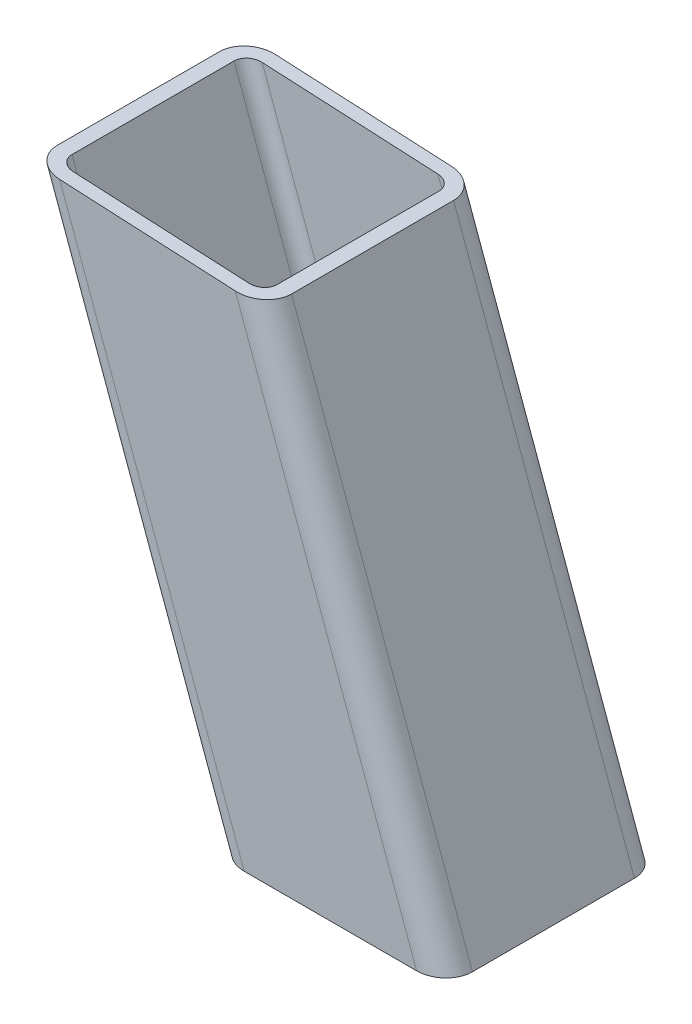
ISO-10303-21;
HEADER;
FILE_DESCRIPTION(('STEP AP214'),'2;1');
FILE_NAME('part.step','',(''),(''),'','','');
FILE_SCHEMA(('AUTOMOTIVE_DESIGN { 1 0 10303 214 1 1 1 1 }'));
ENDSEC;
DATA;
#1=APPLICATION_CONTEXT('core data for automotive mechanical design processes');
#2=APPLICATION_PROTOCOL_DEFINITION('international standard','automotive_design',2000,#1);
#3=PRODUCT_CONTEXT('',#1,'mechanical');
#4=PRODUCT('Part','Part','',(#3));
#5=PRODUCT_RELATED_PRODUCT_CATEGORY('part','',(#4));
#6=PRODUCT_DEFINITION_FORMATION('','',#4);
#7=PRODUCT_DEFINITION_CONTEXT('part definition',#1,'design');
#8=PRODUCT_DEFINITION('design','',#6,#7);
#9=PRODUCT_DEFINITION_SHAPE('','',#8);
#10=(LENGTH_UNIT() NAMED_UNIT(*) SI_UNIT(.MILLI.,.METRE.));
#11=(NAMED_UNIT(*) PLANE_ANGLE_UNIT() SI_UNIT($,.RADIAN.));
#12=(NAMED_UNIT(*) SI_UNIT($,.STERADIAN.) SOLID_ANGLE_UNIT());
#13=UNCERTAINTY_MEASURE_WITH_UNIT(LENGTH_MEASURE(1.E-05),#10,'distance_accuracy_value','');
#14=(GEOMETRIC_REPRESENTATION_CONTEXT(3) GLOBAL_UNCERTAINTY_ASSIGNED_CONTEXT((#13)) GLOBAL_UNIT_ASSIGNED_CONTEXT((#10,
#11,#12)) REPRESENTATION_CONTEXT('',''));
#15=CARTESIAN_POINT('',(0.,0.,0.));
#16=DIRECTION('',(0.,0.,1.));
#17=DIRECTION('',(1.,0.,0.));
#18=AXIS2_PLACEMENT_3D('',#15,#16,#17);
#19=CARTESIAN_POINT('',(2568.84586301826,13.6808057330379,30.));
#20=DIRECTION('',(-0.939692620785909,-0.342020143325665,0.));
#21=DIRECTION('',(0.342020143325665,-0.93969262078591,0.));
#22=AXIS2_PLACEMENT_3D('',#19,#20,#21);
#23=PLANE('',#22);
#24=DIRECTION('',(0.,0.,1.));
#25=VECTOR('',#24,1.);
#26=CARTESIAN_POINT('',(2553.07896573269,56.9999999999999,30.0000000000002));
#27=LINE('',#26,#25);
#28=CARTESIAN_POINT('',(2553.07896573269,57.,-30.));
#29=VERTEX_POINT('',#28);
#30=CARTESIAN_POINT('',(2553.07896573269,56.9999999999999,30.));
#31=VERTEX_POINT('',#30);
#32=EDGE_CURVE('E53',#29,#31,#27,.T.);
#33=ORIENTED_EDGE('',*,*,#32,.F.);
#34=DIRECTION('',(-0.342020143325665,0.93969262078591,0.));
#35=VECTOR('',#34,1.);
#36=CARTESIAN_POINT('',(2568.84586301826,13.6808057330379,-30.));
#37=LINE('',#36,#35);
#38=CARTESIAN_POINT('',(2486.14102471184,240.910481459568,-30.));
#39=VERTEX_POINT('',#38);
#40=EDGE_CURVE('E38',#29,#39,#37,.T.);
#41=ORIENTED_EDGE('',*,*,#40,.T.);
#42=DIRECTION('',(0.,0.,-1.));
#43=VECTOR('',#42,1.);
#44=CARTESIAN_POINT('',(2486.14102471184,240.910481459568,30.));
#45=LINE('',#44,#43);
#46=CARTESIAN_POINT('',(2486.14102471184,240.910481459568,30.));
#47=VERTEX_POINT('',#46);
#48=EDGE_CURVE('E107',#47,#39,#45,.T.);
#49=ORIENTED_EDGE('',*,*,#48,.F.);
#50=DIRECTION('',(-0.342020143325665,0.93969262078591,0.));
#51=VECTOR('',#50,1.);
#52=CARTESIAN_POINT('',(2568.84586301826,13.6808057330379,30.));
#53=LINE('',#52,#51);
#54=EDGE_CURVE('E185',#31,#47,#53,.T.);
#55=ORIENTED_EDGE('',*,*,#54,.F.);
#56=EDGE_LOOP('',(#33,#41,#49,#55));
#57=FACE_BOUND('',#56,.T.);
#58=ADVANCED_FACE('F34',(#57),#23,.F.);
#59=CARTESIAN_POINT('',(2559.4489368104,10.2606042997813,-30.));
#60=DIRECTION('',(-0.342020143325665,0.93969262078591,0.));
#61=DIRECTION('',(-0.93969262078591,-0.342020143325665,0.));
#62=AXIS2_PLACEMENT_3D('',#59,#60,#61);
#63=CYLINDRICAL_SURFACE('',#62,10.);
#64=CARTESIAN_POINT('',(2542.43718800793,57.0000000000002,-30.));
#65=DIRECTION('',(0.,-1.,0.));
#66=DIRECTION('',(-1.,0.,0.));
#67=AXIS2_PLACEMENT_3D('',#64,#65,#66);
#68=ELLIPSE('',#67,10.6417777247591,10.);
#69=CARTESIAN_POINT('',(2542.43718800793,57.0000000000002,-40.));
#70=VERTEX_POINT('',#69);
#71=EDGE_CURVE('E155',#70,#29,#68,.T.);
#72=ORIENTED_EDGE('',*,*,#71,.F.);
#73=DIRECTION('',(-0.342020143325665,0.93969262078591,0.));
#74=VECTOR('',#73,1.);
#75=CARTESIAN_POINT('',(2559.4489368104,10.2606042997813,-40.));
#76=LINE('',#75,#74);
#77=CARTESIAN_POINT('',(2475.30171823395,241.453187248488,-40.));
#78=VERTEX_POINT('',#77);
#79=EDGE_CURVE('E165',#70,#78,#76,.T.);
#80=ORIENTED_EDGE('',*,*,#79,.T.);
#81=CARTESIAN_POINT('',(2475.30171823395,241.453187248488,-30.));
#82=DIRECTION('',(0.0500056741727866,0.998748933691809,0.));
#83=DIRECTION('',(-0.998748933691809,0.0500056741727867,0.));
#84=AXIS2_PLACEMENT_3D('',#81,#82,#83);
#85=ELLIPSE('',#84,10.8528841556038,10.);
#86=EDGE_CURVE('E102',#39,#78,#85,.T.);
#87=ORIENTED_EDGE('',*,*,#86,.F.);
#88=ORIENTED_EDGE('',*,*,#40,.F.);
#89=EDGE_LOOP('',(#72,#80,#87,#88));
#90=FACE_BOUND('',#89,.T.);
#91=ADVANCED_FACE('F164',(#90),#63,.T.);
#92=CARTESIAN_POINT('',(2503.06737956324,-10.2606042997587,-40.));
#93=DIRECTION('',(0.,0.,1.));
#94=DIRECTION('',(1.,0.,0.));
#95=AXIS2_PLACEMENT_3D('',#92,#93,#94);
#96=PLANE('',#95);
#97=DIRECTION('',(1.,0.,0.));
#98=VECTOR('',#97,1.);
#99=CARTESIAN_POINT('',(2503.06737956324,57.0000000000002,-40.));
#100=LINE('',#99,#98);
#101=CARTESIAN_POINT('',(2478.58652165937,57.0000000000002,-40.));
#102=VERTEX_POINT('',#101);
#103=EDGE_CURVE('E152',#102,#70,#100,.T.);
#104=ORIENTED_EDGE('',*,*,#103,.F.);
#105=DIRECTION('',(-0.342020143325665,0.93969262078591,0.));
#106=VECTOR('',#105,1.);
#107=CARTESIAN_POINT('',(2503.06737956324,-10.2606042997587,-40.));
#108=LINE('',#107,#106);
#109=CARTESIAN_POINT('',(2410.26587936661,244.709421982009,-40.));
#110=VERTEX_POINT('',#109);
#111=EDGE_CURVE('E170',#102,#110,#108,.T.);
#112=ORIENTED_EDGE('',*,*,#111,.T.);
#113=DIRECTION('',(-0.998748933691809,0.0500056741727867,0.));
#114=VECTOR('',#113,1.);
#115=CARTESIAN_POINT('',(2515.56932018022,239.437056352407,-40.));
#116=LINE('',#115,#114);
#117=EDGE_CURVE('E169',#78,#110,#116,.T.);
#118=ORIENTED_EDGE('',*,*,#117,.F.);
#119=ORIENTED_EDGE('',*,*,#79,.F.);
#120=EDGE_LOOP('',(#104,#112,#118,#119));
#121=FACE_BOUND('',#120,.T.);
#122=ADVANCED_FACE('F168',(#121),#96,.F.);
#123=CARTESIAN_POINT('',(2503.06737956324,-10.2606042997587,-30.));
#124=DIRECTION('',(-0.342020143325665,0.93969262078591,0.));
#125=DIRECTION('',(-0.93969262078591,-0.342020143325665,0.));
#126=AXIS2_PLACEMENT_3D('',#123,#124,#125);
#127=CYLINDRICAL_SURFACE('',#126,10.);
#128=CARTESIAN_POINT('',(2478.58652165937,57.0000000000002,-30.));
#129=DIRECTION('',(0.,-1.,0.));
#130=DIRECTION('',(-1.,0.,0.));
#131=AXIS2_PLACEMENT_3D('',#128,#129,#130);
#132=ELLIPSE('',#131,10.6417777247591,10.);
#133=CARTESIAN_POINT('',(2467.94474393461,57.0000000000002,-30.));
#134=VERTEX_POINT('',#133);
#135=EDGE_CURVE('E150',#134,#102,#132,.T.);
#136=ORIENTED_EDGE('',*,*,#135,.F.);
#137=DIRECTION('',(-0.342020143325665,0.93969262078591,0.));
#138=VECTOR('',#137,1.);
#139=CARTESIAN_POINT('',(2493.67045335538,-13.6808057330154,-30.));
#140=LINE('',#139,#138);
#141=CARTESIAN_POINT('',(2399.42657288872,245.252127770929,-30.));
#142=VERTEX_POINT('',#141);
#143=EDGE_CURVE('E171',#134,#142,#140,.T.);
#144=ORIENTED_EDGE('',*,*,#143,.T.);
#145=CARTESIAN_POINT('',(2410.26587936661,244.709421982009,-30.));
#146=DIRECTION('',(0.0500056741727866,0.998748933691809,0.));
#147=DIRECTION('',(-0.998748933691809,0.0500056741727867,0.));
#148=AXIS2_PLACEMENT_3D('',#145,#146,#147);
#149=ELLIPSE('',#148,10.8528841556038,10.);
#150=EDGE_CURVE('E228',#110,#142,#149,.T.);
#151=ORIENTED_EDGE('',*,*,#150,.F.);
#152=ORIENTED_EDGE('',*,*,#111,.F.);
#153=EDGE_LOOP('',(#136,#144,#151,#152));
#154=FACE_BOUND('',#153,.T.);
#155=ADVANCED_FACE('F325',(#154),#127,.T.);
#156=CARTESIAN_POINT('',(2493.67045335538,-13.6808057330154,-30.));
#157=DIRECTION('',(0.939692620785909,0.342020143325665,0.));
#158=DIRECTION('',(-0.342020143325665,0.93969262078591,0.));
#159=AXIS2_PLACEMENT_3D('',#156,#157,#158);
#160=PLANE('',#159);
#161=DIRECTION('',(0.,0.,-1.));
#162=VECTOR('',#161,1.);
#163=CARTESIAN_POINT('',(2467.94474393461,57.0000000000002,-29.9999999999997));
#164=LINE('',#163,#162);
#165=CARTESIAN_POINT('',(2467.94474393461,56.9999999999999,30.));
#166=VERTEX_POINT('',#165);
#167=EDGE_CURVE('E253',#166,#134,#164,.T.);
#168=ORIENTED_EDGE('',*,*,#167,.F.);
#169=DIRECTION('',(-0.342020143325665,0.93969262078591,0.));
#170=VECTOR('',#169,1.);
#171=CARTESIAN_POINT('',(2493.67045335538,-13.6808057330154,30.));
#172=LINE('',#171,#170);
#173=CARTESIAN_POINT('',(2399.42657288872,245.252127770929,30.));
#174=VERTEX_POINT('',#173);
#175=EDGE_CURVE('E176',#166,#174,#172,.T.);
#176=ORIENTED_EDGE('',*,*,#175,.T.);
#177=DIRECTION('',(0.,0.,1.));
#178=VECTOR('',#177,1.);
#179=CARTESIAN_POINT('',(2399.42657288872,245.252127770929,-30.0000000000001));
#180=LINE('',#179,#178);
#181=EDGE_CURVE('E230',#142,#174,#180,.T.);
#182=ORIENTED_EDGE('',*,*,#181,.F.);
#183=ORIENTED_EDGE('',*,*,#143,.F.);
#184=EDGE_LOOP('',(#168,#176,#182,#183));
#185=FACE_BOUND('',#184,.T.);
#186=ADVANCED_FACE('F328',(#185),#160,.F.);
#187=CARTESIAN_POINT('',(2503.06737956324,-10.2606042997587,30.));
#188=DIRECTION('',(-0.342020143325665,0.93969262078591,0.));
#189=DIRECTION('',(-0.93969262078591,-0.342020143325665,0.));
#190=AXIS2_PLACEMENT_3D('',#187,#188,#189);
#191=CYLINDRICAL_SURFACE('',#190,10.);
#192=CARTESIAN_POINT('',(2478.58652165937,56.9999999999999,30.));
#193=DIRECTION('',(0.,-1.,0.));
#194=DIRECTION('',(-1.,0.,0.));
#195=AXIS2_PLACEMENT_3D('',#192,#193,#194);
#196=ELLIPSE('',#195,10.6417777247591,10.);
#197=CARTESIAN_POINT('',(2478.58652165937,56.9999999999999,40.));
#198=VERTEX_POINT('',#197);
#199=EDGE_CURVE('E255',#198,#166,#196,.T.);
#200=ORIENTED_EDGE('',*,*,#199,.F.);
#201=DIRECTION('',(-0.342020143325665,0.93969262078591,0.));
#202=VECTOR('',#201,1.);
#203=CARTESIAN_POINT('',(2503.06737956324,-10.2606042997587,40.));
#204=LINE('',#203,#202);
#205=CARTESIAN_POINT('',(2410.26587936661,244.709421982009,40.));
#206=VERTEX_POINT('',#205);
#207=EDGE_CURVE('E179',#198,#206,#204,.T.);
#208=ORIENTED_EDGE('',*,*,#207,.T.);
#209=CARTESIAN_POINT('',(2410.26587936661,244.709421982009,30.));
#210=DIRECTION('',(0.0500056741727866,0.998748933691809,0.));
#211=DIRECTION('',(-0.998748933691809,0.0500056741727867,0.));
#212=AXIS2_PLACEMENT_3D('',#209,#210,#211);
#213=ELLIPSE('',#212,10.8528841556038,10.);
#214=EDGE_CURVE('E232',#174,#206,#213,.T.);
#215=ORIENTED_EDGE('',*,*,#214,.F.);
#216=ORIENTED_EDGE('',*,*,#175,.F.);
#217=EDGE_LOOP('',(#200,#208,#215,#216));
#218=FACE_BOUND('',#217,.T.);
#219=ADVANCED_FACE('F332',(#218),#191,.T.);
#220=CARTESIAN_POINT('',(2559.4489368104,10.2606042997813,40.));
#221=DIRECTION('',(0.,0.,-1.));
#222=DIRECTION('',(-1.,0.,0.));
#223=AXIS2_PLACEMENT_3D('',#220,#221,#222);
#224=PLANE('',#223);
#225=DIRECTION('',(-1.,0.,0.));
#226=VECTOR('',#225,1.);
#227=CARTESIAN_POINT('',(2559.4489368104,56.9999999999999,40.));
#228=LINE('',#227,#226);
#229=CARTESIAN_POINT('',(2542.43718800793,56.9999999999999,40.));
#230=VERTEX_POINT('',#229);
#231=EDGE_CURVE('E257',#230,#198,#228,.T.);
#232=ORIENTED_EDGE('',*,*,#231,.F.);
#233=DIRECTION('',(-0.342020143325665,0.93969262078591,0.));
#234=VECTOR('',#233,1.);
#235=CARTESIAN_POINT('',(2559.4489368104,10.2606042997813,40.));
#236=LINE('',#235,#234);
#237=CARTESIAN_POINT('',(2475.30171823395,241.453187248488,40.));
#238=VERTEX_POINT('',#237);
#239=EDGE_CURVE('E182',#230,#238,#236,.T.);
#240=ORIENTED_EDGE('',*,*,#239,.T.);
#241=DIRECTION('',(0.998748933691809,-0.0500056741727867,0.));
#242=VECTOR('',#241,1.);
#243=CARTESIAN_POINT('',(2570.78499848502,236.672500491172,40.));
#244=LINE('',#243,#242);
#245=EDGE_CURVE('E234',#206,#238,#244,.T.);
#246=ORIENTED_EDGE('',*,*,#245,.F.);
#247=ORIENTED_EDGE('',*,*,#207,.F.);
#248=EDGE_LOOP('',(#232,#240,#246,#247));
#249=FACE_BOUND('',#248,.T.);
#250=ADVANCED_FACE('F335',(#249),#224,.F.);
#251=CARTESIAN_POINT('',(2559.4489368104,10.2606042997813,30.));
#252=DIRECTION('',(-0.342020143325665,0.93969262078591,0.));
#253=DIRECTION('',(-0.93969262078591,-0.342020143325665,0.));
#254=AXIS2_PLACEMENT_3D('',#251,#252,#253);
#255=CYLINDRICAL_SURFACE('',#254,10.);
#256=CARTESIAN_POINT('',(2542.43718800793,56.9999999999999,30.));
#257=DIRECTION('',(0.,-1.,0.));
#258=DIRECTION('',(-1.,0.,0.));
#259=AXIS2_PLACEMENT_3D('',#256,#257,#258);
#260=ELLIPSE('',#259,10.6417777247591,10.);
#261=EDGE_CURVE('E236',#31,#230,#260,.T.);
#262=ORIENTED_EDGE('',*,*,#261,.F.);
#263=ORIENTED_EDGE('',*,*,#54,.T.);
#264=CARTESIAN_POINT('',(2475.30171823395,241.453187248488,30.));
#265=DIRECTION('',(0.0500056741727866,0.998748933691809,0.));
#266=DIRECTION('',(-0.998748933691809,0.0500056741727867,0.));
#267=AXIS2_PLACEMENT_3D('',#264,#265,#266);
#268=ELLIPSE('',#267,10.8528841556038,10.);
#269=EDGE_CURVE('E110',#238,#47,#268,.T.);
#270=ORIENTED_EDGE('',*,*,#269,.F.);
#271=ORIENTED_EDGE('',*,*,#239,.F.);
#272=EDGE_LOOP('',(#262,#263,#270,#271));
#273=FACE_BOUND('',#272,.T.);
#274=ADVANCED_FACE('F36',(#273),#255,.T.);
#275=CARTESIAN_POINT('',(6158.08276398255,57.0625533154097,-40.));
#276=DIRECTION('',(0.0500056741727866,0.998748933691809,0.));
#277=DIRECTION('',(-0.998748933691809,0.0500056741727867,0.));
#278=AXIS2_PLACEMENT_3D('',#275,#276,#277);
#279=PLANE('',#278);
#280=DIRECTION('',(0.,0.,1.));
#281=VECTOR('',#280,1.);
#282=CARTESIAN_POINT('',(2404.84622612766,244.980774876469,-30.));
#283=LINE('',#282,#281);
#284=CARTESIAN_POINT('',(2404.84622612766,244.980774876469,-30.));
#285=VERTEX_POINT('',#284);
#286=CARTESIAN_POINT('',(2404.84622612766,244.980774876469,30.));
#287=VERTEX_POINT('',#286);
#288=EDGE_CURVE('E191',#285,#287,#283,.T.);
#289=ORIENTED_EDGE('',*,*,#288,.F.);
#290=CARTESIAN_POINT('',(2410.26587936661,244.709421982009,-30.));
#291=DIRECTION('',(0.0500056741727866,0.998748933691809,0.));
#292=DIRECTION('',(-0.998748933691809,0.0500056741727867,0.));
#293=AXIS2_PLACEMENT_3D('',#290,#291,#292);
#294=ELLIPSE('',#293,5.4264420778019,5.00000000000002);
#295=CARTESIAN_POINT('',(2410.26587936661,244.709421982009,-35.));
#296=VERTEX_POINT('',#295);
#297=EDGE_CURVE('E196',#296,#285,#294,.T.);
#298=ORIENTED_EDGE('',*,*,#297,.F.);
#299=DIRECTION('',(-0.998748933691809,0.0500056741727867,0.));
#300=VECTOR('',#299,1.);
#301=CARTESIAN_POINT('',(2515.56932018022,239.437056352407,-35.));
#302=LINE('',#301,#300);
#303=CARTESIAN_POINT('',(2475.30171823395,241.453187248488,-35.));
#304=VERTEX_POINT('',#303);
#305=EDGE_CURVE('E201',#304,#296,#302,.T.);
#306=ORIENTED_EDGE('',*,*,#305,.F.);
#307=CARTESIAN_POINT('',(2475.30171823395,241.453187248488,-30.));
#308=DIRECTION('',(0.0500056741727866,0.998748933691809,0.));
#309=DIRECTION('',(-0.998748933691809,0.0500056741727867,0.));
#310=AXIS2_PLACEMENT_3D('',#307,#308,#309);
#311=ELLIPSE('',#310,5.42644207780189,5.00000000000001);
#312=CARTESIAN_POINT('',(2480.72137147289,241.181834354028,-30.));
#313=VERTEX_POINT('',#312);
#314=EDGE_CURVE('E206',#313,#304,#311,.T.);
#315=ORIENTED_EDGE('',*,*,#314,.F.);
#316=DIRECTION('',(0.,0.,-1.));
#317=VECTOR('',#316,1.);
#318=CARTESIAN_POINT('',(2480.72137147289,241.181834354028,30.));
#319=LINE('',#318,#317);
#320=CARTESIAN_POINT('',(2480.72137147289,241.181834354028,30.));
#321=VERTEX_POINT('',#320);
#322=EDGE_CURVE('E211',#321,#313,#319,.T.);
#323=ORIENTED_EDGE('',*,*,#322,.F.);
#324=CARTESIAN_POINT('',(2475.30171823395,241.453187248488,30.));
#325=DIRECTION('',(0.0500056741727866,0.998748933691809,0.));
#326=DIRECTION('',(-0.998748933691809,0.0500056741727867,0.));
#327=AXIS2_PLACEMENT_3D('',#324,#325,#326);
#328=ELLIPSE('',#327,5.42644207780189,5.00000000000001);
#329=CARTESIAN_POINT('',(2475.30171823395,241.453187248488,35.));
#330=VERTEX_POINT('',#329);
#331=EDGE_CURVE('E216',#330,#321,#328,.T.);
#332=ORIENTED_EDGE('',*,*,#331,.F.);
#333=DIRECTION('',(0.998748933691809,-0.0500056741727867,0.));
#334=VECTOR('',#333,1.);
#335=CARTESIAN_POINT('',(2570.78499848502,236.672500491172,35.));
#336=LINE('',#335,#334);
#337=CARTESIAN_POINT('',(2410.26587936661,244.709421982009,35.));
#338=VERTEX_POINT('',#337);
#339=EDGE_CURVE('E221',#338,#330,#336,.T.);
#340=ORIENTED_EDGE('',*,*,#339,.F.);
#341=CARTESIAN_POINT('',(2410.26587936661,244.709421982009,30.));
#342=DIRECTION('',(0.0500056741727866,0.998748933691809,0.));
#343=DIRECTION('',(-0.998748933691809,0.0500056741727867,0.));
#344=AXIS2_PLACEMENT_3D('',#341,#342,#343);
#345=ELLIPSE('',#344,5.42644207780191,5.00000000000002);
#346=EDGE_CURVE('E11',#287,#338,#345,.T.);
#347=ORIENTED_EDGE('',*,*,#346,.F.);
#348=EDGE_LOOP('',(#289,#298,#306,#315,#323,#332,#340,#347));
#349=FACE_BOUND('',#348,.T.);
#350=ORIENTED_EDGE('',*,*,#269,.T.);
#351=ORIENTED_EDGE('',*,*,#48,.T.);
#352=ORIENTED_EDGE('',*,*,#86,.T.);
#353=ORIENTED_EDGE('',*,*,#117,.T.);
#354=ORIENTED_EDGE('',*,*,#150,.T.);
#355=ORIENTED_EDGE('',*,*,#181,.T.);
#356=ORIENTED_EDGE('',*,*,#214,.T.);
#357=ORIENTED_EDGE('',*,*,#245,.T.);
#358=EDGE_LOOP('',(#350,#351,#352,#353,#354,#355,#356,#357));
#359=FACE_BOUND('',#358,.T.);
#360=ADVANCED_FACE('F286',(#349,#359),#279,.T.);
#361=CARTESIAN_POINT('',(9149.96897120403,57.0000000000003,-59.9999999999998));
#362=DIRECTION('',(0.,-1.,0.));
#363=DIRECTION('',(0.,0.,-1.));
#364=AXIS2_PLACEMENT_3D('',#361,#362,#363);
#365=PLANE('',#364);
#366=DIRECTION('',(-1.,0.,0.));
#367=VECTOR('',#366,1.);
#368=CARTESIAN_POINT('',(2559.4489368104,56.9999999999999,35.));
#369=LINE('',#368,#367);
#370=CARTESIAN_POINT('',(2542.43718800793,56.9999999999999,35.));
#371=VERTEX_POINT('',#370);
#372=CARTESIAN_POINT('',(2478.58652165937,56.9999999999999,35.));
#373=VERTEX_POINT('',#372);
#374=EDGE_CURVE('E222',#371,#373,#369,.T.);
#375=ORIENTED_EDGE('',*,*,#374,.F.);
#376=CARTESIAN_POINT('',(2542.43718800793,56.9999999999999,30.));
#377=DIRECTION('',(0.,-1.,0.));
#378=DIRECTION('',(-1.,0.,0.));
#379=AXIS2_PLACEMENT_3D('',#376,#377,#378);
#380=ELLIPSE('',#379,5.32088886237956,5.00000000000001);
#381=CARTESIAN_POINT('',(2547.75807687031,56.9999999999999,30.));
#382=VERTEX_POINT('',#381);
#383=EDGE_CURVE('E217',#382,#371,#380,.T.);
#384=ORIENTED_EDGE('',*,*,#383,.F.);
#385=DIRECTION('',(0.,0.,1.));
#386=VECTOR('',#385,1.);
#387=CARTESIAN_POINT('',(2547.75807687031,56.9999999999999,30.0000000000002));
#388=LINE('',#387,#386);
#389=CARTESIAN_POINT('',(2547.75807687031,57.0000000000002,-30.));
#390=VERTEX_POINT('',#389);
#391=EDGE_CURVE('E212',#390,#382,#388,.T.);
#392=ORIENTED_EDGE('',*,*,#391,.F.);
#393=CARTESIAN_POINT('',(2542.43718800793,57.0000000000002,-30.));
#394=DIRECTION('',(0.,-1.,0.));
#395=DIRECTION('',(-1.,0.,0.));
#396=AXIS2_PLACEMENT_3D('',#393,#394,#395);
#397=ELLIPSE('',#396,5.32088886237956,5.00000000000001);
#398=CARTESIAN_POINT('',(2542.43718800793,57.0000000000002,-35.));
#399=VERTEX_POINT('',#398);
#400=EDGE_CURVE('E207',#399,#390,#397,.T.);
#401=ORIENTED_EDGE('',*,*,#400,.F.);
#402=DIRECTION('',(1.,0.,0.));
#403=VECTOR('',#402,1.);
#404=CARTESIAN_POINT('',(2503.06737956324,57.0000000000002,-35.));
#405=LINE('',#404,#403);
#406=CARTESIAN_POINT('',(2478.58652165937,57.0000000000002,-35.));
#407=VERTEX_POINT('',#406);
#408=EDGE_CURVE('E202',#407,#399,#405,.T.);
#409=ORIENTED_EDGE('',*,*,#408,.F.);
#410=CARTESIAN_POINT('',(2478.58652165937,57.0000000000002,-30.));
#411=DIRECTION('',(0.,-1.,0.));
#412=DIRECTION('',(-1.,0.,0.));
#413=AXIS2_PLACEMENT_3D('',#410,#411,#412);
#414=ELLIPSE('',#413,5.32088886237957,5.00000000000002);
#415=CARTESIAN_POINT('',(2473.26563279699,57.0000000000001,-30.));
#416=VERTEX_POINT('',#415);
#417=EDGE_CURVE('E197',#416,#407,#414,.T.);
#418=ORIENTED_EDGE('',*,*,#417,.F.);
#419=DIRECTION('',(0.,0.,-1.));
#420=VECTOR('',#419,1.);
#421=CARTESIAN_POINT('',(2473.26563279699,57.0000000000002,-29.9999999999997));
#422=LINE('',#421,#420);
#423=CARTESIAN_POINT('',(2473.26563279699,56.9999999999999,30.));
#424=VERTEX_POINT('',#423);
#425=EDGE_CURVE('E192',#424,#416,#422,.T.);
#426=ORIENTED_EDGE('',*,*,#425,.F.);
#427=CARTESIAN_POINT('',(2478.58652165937,56.9999999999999,30.));
#428=DIRECTION('',(0.,-1.,0.));
#429=DIRECTION('',(-1.,0.,0.));
#430=AXIS2_PLACEMENT_3D('',#427,#428,#429);
#431=ELLIPSE('',#430,5.32088886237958,5.00000000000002);
#432=EDGE_CURVE('E225',#373,#424,#431,.T.);
#433=ORIENTED_EDGE('',*,*,#432,.F.);
#434=EDGE_LOOP('',(#375,#384,#392,#401,#409,#418,#426,#433));
#435=FACE_BOUND('',#434,.T.);
#436=ORIENTED_EDGE('',*,*,#261,.T.);
#437=ORIENTED_EDGE('',*,*,#231,.T.);
#438=ORIENTED_EDGE('',*,*,#199,.T.);
#439=ORIENTED_EDGE('',*,*,#167,.T.);
#440=ORIENTED_EDGE('',*,*,#135,.T.);
#441=ORIENTED_EDGE('',*,*,#103,.T.);
#442=ORIENTED_EDGE('',*,*,#71,.T.);
#443=ORIENTED_EDGE('',*,*,#32,.T.);
#444=EDGE_LOOP('',(#436,#437,#438,#439,#440,#441,#442,#443));
#445=FACE_BOUND('',#444,.T.);
#446=ADVANCED_FACE('F154',(#435,#445),#365,.T.);
#447=CARTESIAN_POINT('',(2498.36891645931,-11.9707050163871,-30.));
#448=DIRECTION('',(0.93969262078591,0.342020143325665,0.));
#449=DIRECTION('',(-0.342020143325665,0.93969262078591,0.));
#450=AXIS2_PLACEMENT_3D('',#447,#448,#449);
#451=PLANE('',#450);
#452=DIRECTION('',(-0.342020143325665,0.93969262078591,0.));
#453=VECTOR('',#452,1.);
#454=CARTESIAN_POINT('',(2498.36891645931,-11.9707050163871,30.));
#455=LINE('',#454,#453);
#456=EDGE_CURVE('E44',#424,#287,#455,.T.);
#457=ORIENTED_EDGE('',*,*,#456,.F.);
#458=ORIENTED_EDGE('',*,*,#425,.T.);
#459=DIRECTION('',(-0.342020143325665,0.93969262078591,0.));
#460=VECTOR('',#459,1.);
#461=CARTESIAN_POINT('',(2498.36891645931,-11.9707050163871,-30.));
#462=LINE('',#461,#460);
#463=EDGE_CURVE('E188',#416,#285,#462,.T.);
#464=ORIENTED_EDGE('',*,*,#463,.T.);
#465=ORIENTED_EDGE('',*,*,#288,.T.);
#466=EDGE_LOOP('',(#457,#458,#464,#465));
#467=FACE_BOUND('',#466,.T.);
#468=ADVANCED_FACE('F283',(#467),#451,.T.);
#469=CARTESIAN_POINT('',(2503.06737956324,-10.2606042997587,-30.));
#470=DIRECTION('',(-0.342020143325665,0.93969262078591,0.));
#471=DIRECTION('',(-0.93969262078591,-0.342020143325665,0.));
#472=AXIS2_PLACEMENT_3D('',#469,#470,#471);
#473=CYLINDRICAL_SURFACE('',#472,5.00000000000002);
#474=ORIENTED_EDGE('',*,*,#463,.F.);
#475=ORIENTED_EDGE('',*,*,#417,.T.);
#476=DIRECTION('',(-0.342020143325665,0.93969262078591,0.));
#477=VECTOR('',#476,1.);
#478=CARTESIAN_POINT('',(2503.06737956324,-10.2606042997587,-35.));
#479=LINE('',#478,#477);
#480=EDGE_CURVE('E193',#407,#296,#479,.T.);
#481=ORIENTED_EDGE('',*,*,#480,.T.);
#482=ORIENTED_EDGE('',*,*,#297,.T.);
#483=EDGE_LOOP('',(#474,#475,#481,#482));
#484=FACE_BOUND('',#483,.T.);
#485=ADVANCED_FACE('F288',(#484),#473,.F.);
#486=CARTESIAN_POINT('',(2503.06737956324,-10.2606042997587,-35.));
#487=DIRECTION('',(0.,0.,1.));
#488=DIRECTION('',(1.,0.,0.));
#489=AXIS2_PLACEMENT_3D('',#486,#487,#488);
#490=PLANE('',#489);
#491=ORIENTED_EDGE('',*,*,#480,.F.);
#492=ORIENTED_EDGE('',*,*,#408,.T.);
#493=DIRECTION('',(-0.342020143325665,0.93969262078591,0.));
#494=VECTOR('',#493,1.);
#495=CARTESIAN_POINT('',(2559.4489368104,10.2606042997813,-35.));
#496=LINE('',#495,#494);
#497=EDGE_CURVE('E198',#399,#304,#496,.T.);
#498=ORIENTED_EDGE('',*,*,#497,.T.);
#499=ORIENTED_EDGE('',*,*,#305,.T.);
#500=EDGE_LOOP('',(#491,#492,#498,#499));
#501=FACE_BOUND('',#500,.T.);
#502=ADVANCED_FACE('F292',(#501),#490,.T.);
#503=CARTESIAN_POINT('',(2559.4489368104,10.2606042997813,-30.));
#504=DIRECTION('',(-0.342020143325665,0.93969262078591,0.));
#505=DIRECTION('',(-0.93969262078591,-0.342020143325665,0.));
#506=AXIS2_PLACEMENT_3D('',#503,#504,#505);
#507=CYLINDRICAL_SURFACE('',#506,5.00000000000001);
#508=ORIENTED_EDGE('',*,*,#497,.F.);
#509=ORIENTED_EDGE('',*,*,#400,.T.);
#510=DIRECTION('',(-0.342020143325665,0.93969262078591,0.));
#511=VECTOR('',#510,1.);
#512=CARTESIAN_POINT('',(2564.14739991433,11.9707050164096,-30.));
#513=LINE('',#512,#511);
#514=EDGE_CURVE('E203',#390,#313,#513,.T.);
#515=ORIENTED_EDGE('',*,*,#514,.T.);
#516=ORIENTED_EDGE('',*,*,#314,.T.);
#517=EDGE_LOOP('',(#508,#509,#515,#516));
#518=FACE_BOUND('',#517,.T.);
#519=ADVANCED_FACE('F295',(#518),#507,.F.);
#520=CARTESIAN_POINT('',(2564.14739991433,11.9707050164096,30.));
#521=DIRECTION('',(-0.93969262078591,-0.342020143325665,0.));
#522=DIRECTION('',(0.342020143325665,-0.93969262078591,0.));
#523=AXIS2_PLACEMENT_3D('',#520,#521,#522);
#524=PLANE('',#523);
#525=ORIENTED_EDGE('',*,*,#514,.F.);
#526=ORIENTED_EDGE('',*,*,#391,.T.);
#527=DIRECTION('',(-0.342020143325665,0.93969262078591,0.));
#528=VECTOR('',#527,1.);
#529=CARTESIAN_POINT('',(2564.14739991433,11.9707050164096,30.));
#530=LINE('',#529,#528);
#531=EDGE_CURVE('E208',#382,#321,#530,.T.);
#532=ORIENTED_EDGE('',*,*,#531,.T.);
#533=ORIENTED_EDGE('',*,*,#322,.T.);
#534=EDGE_LOOP('',(#525,#526,#532,#533));
#535=FACE_BOUND('',#534,.T.);
#536=ADVANCED_FACE('F298',(#535),#524,.T.);
#537=CARTESIAN_POINT('',(2559.4489368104,10.2606042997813,30.));
#538=DIRECTION('',(-0.342020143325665,0.93969262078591,0.));
#539=DIRECTION('',(-0.93969262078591,-0.342020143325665,0.));
#540=AXIS2_PLACEMENT_3D('',#537,#538,#539);
#541=CYLINDRICAL_SURFACE('',#540,5.00000000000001);
#542=ORIENTED_EDGE('',*,*,#531,.F.);
#543=ORIENTED_EDGE('',*,*,#383,.T.);
#544=DIRECTION('',(-0.342020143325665,0.93969262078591,0.));
#545=VECTOR('',#544,1.);
#546=CARTESIAN_POINT('',(2559.4489368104,10.2606042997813,35.));
#547=LINE('',#546,#545);
#548=EDGE_CURVE('E213',#371,#330,#547,.T.);
#549=ORIENTED_EDGE('',*,*,#548,.T.);
#550=ORIENTED_EDGE('',*,*,#331,.T.);
#551=EDGE_LOOP('',(#542,#543,#549,#550));
#552=FACE_BOUND('',#551,.T.);
#553=ADVANCED_FACE('F301',(#552),#541,.F.);
#554=CARTESIAN_POINT('',(2559.4489368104,10.2606042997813,35.));
#555=DIRECTION('',(0.,0.,-1.));
#556=DIRECTION('',(-1.,0.,0.));
#557=AXIS2_PLACEMENT_3D('',#554,#555,#556);
#558=PLANE('',#557);
#559=ORIENTED_EDGE('',*,*,#548,.F.);
#560=ORIENTED_EDGE('',*,*,#374,.T.);
#561=DIRECTION('',(-0.342020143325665,0.93969262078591,0.));
#562=VECTOR('',#561,1.);
#563=CARTESIAN_POINT('',(2503.06737956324,-10.2606042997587,35.));
#564=LINE('',#563,#562);
#565=EDGE_CURVE('E218',#373,#338,#564,.T.);
#566=ORIENTED_EDGE('',*,*,#565,.T.);
#567=ORIENTED_EDGE('',*,*,#339,.T.);
#568=EDGE_LOOP('',(#559,#560,#566,#567));
#569=FACE_BOUND('',#568,.T.);
#570=ADVANCED_FACE('F304',(#569),#558,.T.);
#571=CARTESIAN_POINT('',(2503.06737956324,-10.2606042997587,30.));
#572=DIRECTION('',(-0.342020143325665,0.93969262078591,0.));
#573=DIRECTION('',(-0.93969262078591,-0.342020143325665,0.));
#574=AXIS2_PLACEMENT_3D('',#571,#572,#573);
#575=CYLINDRICAL_SURFACE('',#574,5.00000000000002);
#576=ORIENTED_EDGE('',*,*,#565,.F.);
#577=ORIENTED_EDGE('',*,*,#432,.T.);
#578=ORIENTED_EDGE('',*,*,#456,.T.);
#579=ORIENTED_EDGE('',*,*,#346,.T.);
#580=EDGE_LOOP('',(#576,#577,#578,#579));
#581=FACE_BOUND('',#580,.T.);
#582=ADVANCED_FACE('F280',(#581),#575,.F.);
#583=CLOSED_SHELL('',(#58,#91,#122,#155,#186,#219,#250,#274,#360,#446,#468,#485,#502,#519,#536,
#553,#570,#582));
#584=MANIFOLD_SOLID_BREP('B2',#583);
#585=ADVANCED_BREP_SHAPE_REPRESENTATION('',(#18,#584),#14);
#586=SHAPE_DEFINITION_REPRESENTATION(#9,#585);
ENDSEC;
END-ISO-10303-21;
